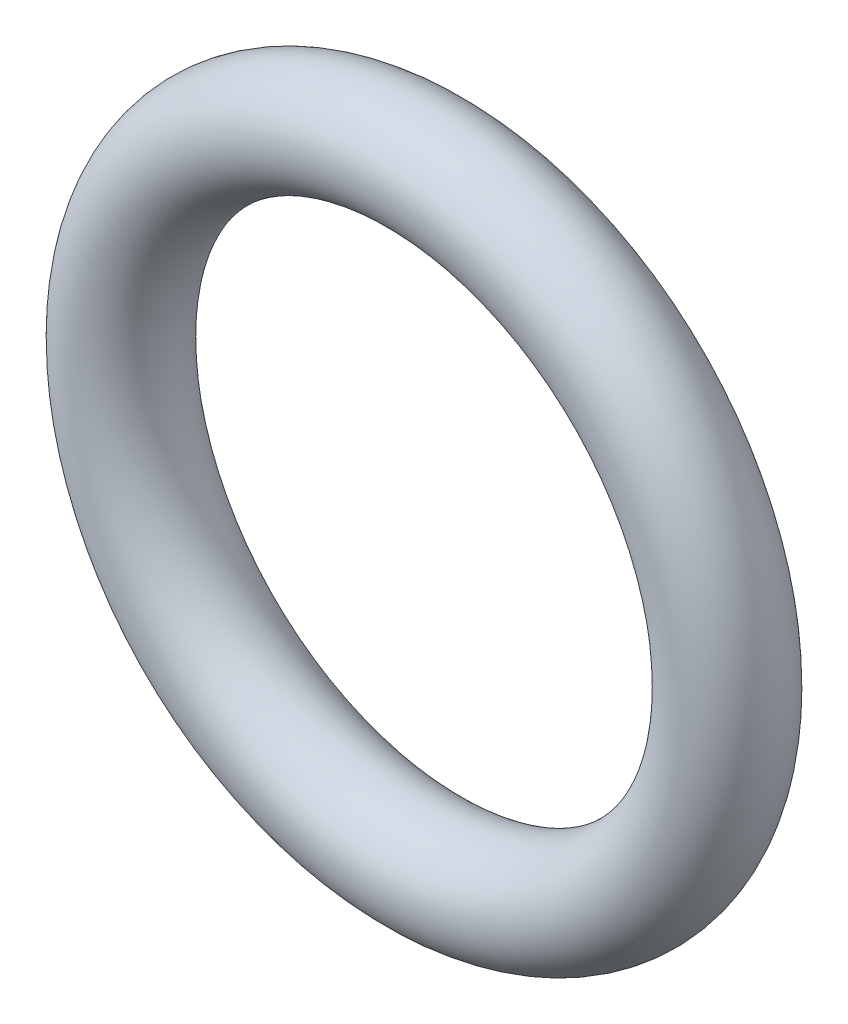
ISO-10303-21;
HEADER;
FILE_DESCRIPTION(('STEP AP214'),'2;1');
FILE_NAME('part.step','',(''),(''),'','','');
FILE_SCHEMA(('AUTOMOTIVE_DESIGN { 1 0 10303 214 1 1 1 1 }'));
ENDSEC;
DATA;
#1=APPLICATION_CONTEXT('core data for automotive mechanical design processes');
#2=APPLICATION_PROTOCOL_DEFINITION('international standard','automotive_design',2000,#1);
#3=PRODUCT_CONTEXT('',#1,'mechanical');
#4=PRODUCT('Part','Part','',(#3));
#5=PRODUCT_RELATED_PRODUCT_CATEGORY('part','',(#4));
#6=PRODUCT_DEFINITION_FORMATION('','',#4);
#7=PRODUCT_DEFINITION_CONTEXT('part definition',#1,'design');
#8=PRODUCT_DEFINITION('design','',#6,#7);
#9=PRODUCT_DEFINITION_SHAPE('','',#8);
#10=(LENGTH_UNIT() NAMED_UNIT(*) SI_UNIT(.MILLI.,.METRE.));
#11=(NAMED_UNIT(*) PLANE_ANGLE_UNIT() SI_UNIT($,.RADIAN.));
#12=(NAMED_UNIT(*) SI_UNIT($,.STERADIAN.) SOLID_ANGLE_UNIT());
#13=UNCERTAINTY_MEASURE_WITH_UNIT(LENGTH_MEASURE(1.E-05),#10,'distance_accuracy_value','');
#14=(GEOMETRIC_REPRESENTATION_CONTEXT(3) GLOBAL_UNCERTAINTY_ASSIGNED_CONTEXT((#13)) GLOBAL_UNIT_ASSIGNED_CONTEXT((#10,
#11,#12)) REPRESENTATION_CONTEXT('',''));
#15=CARTESIAN_POINT('',(0.,0.,0.));
#16=DIRECTION('',(0.,0.,1.));
#17=DIRECTION('',(1.,0.,0.));
#18=AXIS2_PLACEMENT_3D('',#15,#16,#17);
#19=CARTESIAN_POINT('',(0.,0.,0.));
#20=DIRECTION('',(0.,0.,1.));
#21=DIRECTION('',(1.,0.,0.));
#22=AXIS2_PLACEMENT_3D('',#19,#20,#21);
#23=TOROIDAL_SURFACE('',#22,7.493,1.3081);
#24=CARTESIAN_POINT('',(8.8011,0.,0.));
#25=VERTEX_POINT('',#24);
#26=VERTEX_LOOP('',#25);
#27=FACE_BOUND('',#26,.T.);
#28=ADVANCED_FACE('F31',(#27),#23,.T.);
#29=CLOSED_SHELL('',(#28));
#30=MANIFOLD_SOLID_BREP('B2',#29);
#31=ADVANCED_BREP_SHAPE_REPRESENTATION('',(#18,#30),#14);
#32=SHAPE_DEFINITION_REPRESENTATION(#9,#31);
ENDSEC;
END-ISO-10303-21;
